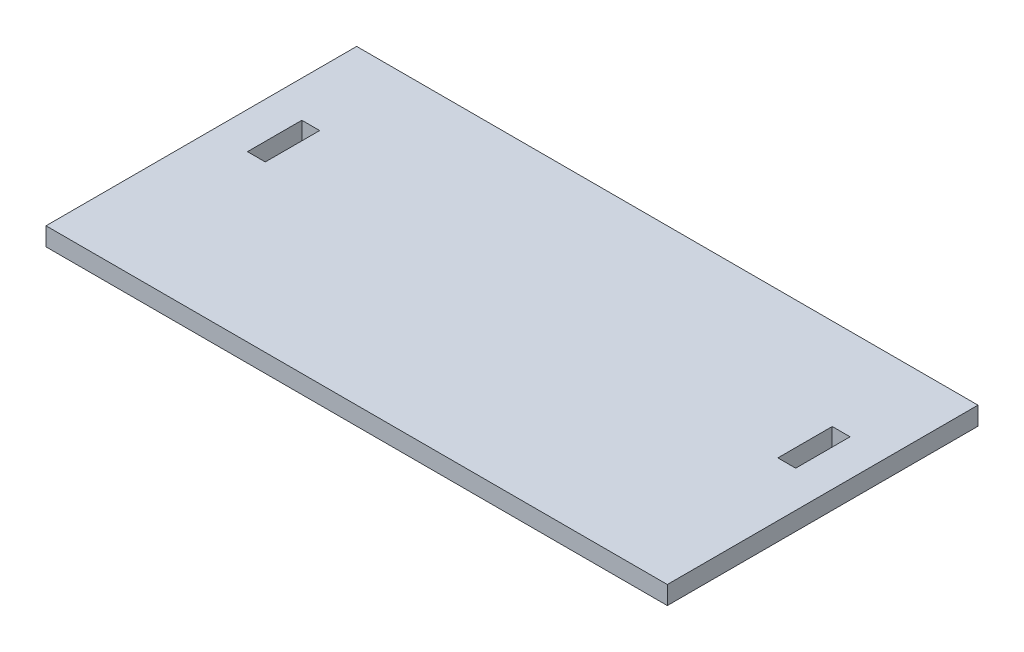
from build123d import *

# Parameters (mm, degrees)
SKETCH1_W           = 340
SKETCH1_H           = 170
SKETCH1_W_2         = 9.76
SKETCH1_H_2         = 29.76
BOSS_EXTRUDE1_DEPTH = 10


with BuildPart() as part:
    # Sketch1 → Boss-Extrude1 (new body)
    with BuildSketch(Plane(origin=(0, 0, 0), x_dir=(1, 0, 0), z_dir=(0, 1, 0))):
        with Locations((101.238398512, -26.78246899)):
            Rectangle(SKETCH1_W, SKETCH1_H)
        with Locations((-43.881601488, -6.66246899)):
            Rectangle(SKETCH1_W_2, SKETCH1_H_2, mode=Mode.SUBTRACT)
        with Locations((246.358398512, -6.66246899)):
            Rectangle(SKETCH1_W_2, SKETCH1_H_2, mode=Mode.SUBTRACT)
    extrude(amount=BOSS_EXTRUDE1_DEPTH)


solid = part.part
